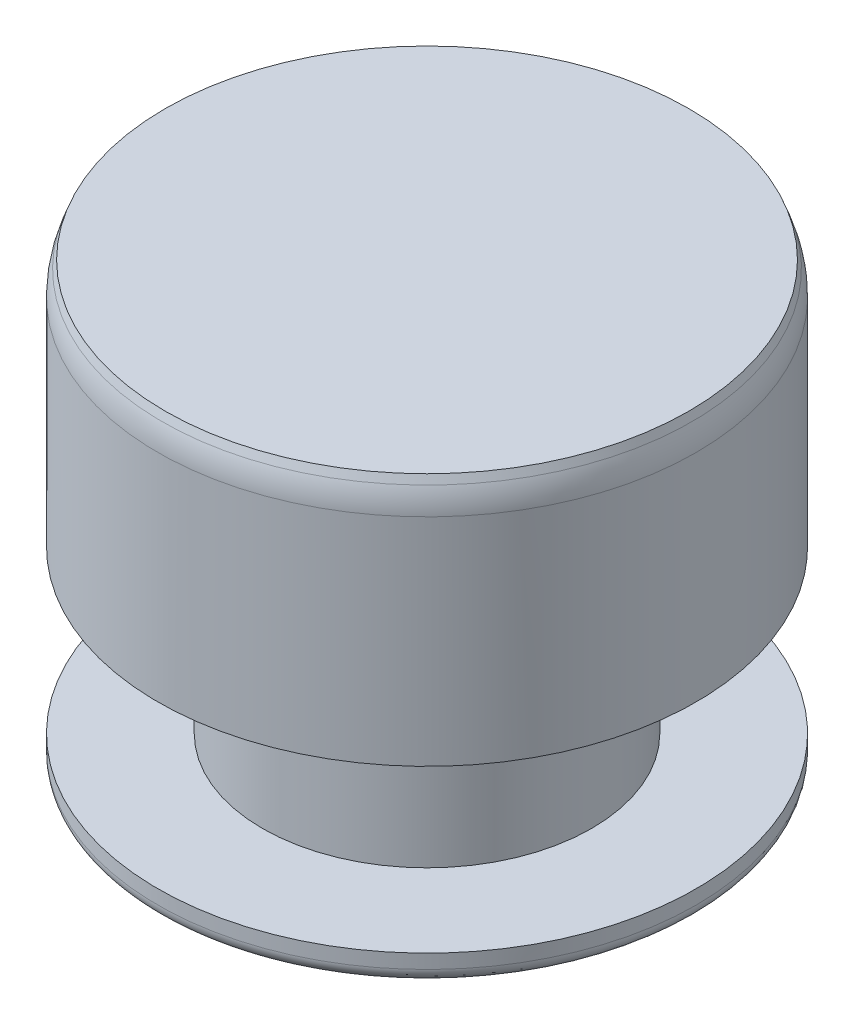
ISO-10303-21;
HEADER;
FILE_DESCRIPTION(('STEP AP214'),'2;1');
FILE_NAME('part.step','',(''),(''),'','','');
FILE_SCHEMA(('AUTOMOTIVE_DESIGN { 1 0 10303 214 1 1 1 1 }'));
ENDSEC;
DATA;
#1=APPLICATION_CONTEXT('core data for automotive mechanical design processes');
#2=APPLICATION_PROTOCOL_DEFINITION('international standard','automotive_design',2000,#1);
#3=PRODUCT_CONTEXT('',#1,'mechanical');
#4=PRODUCT('Part','Part','',(#3));
#5=PRODUCT_RELATED_PRODUCT_CATEGORY('part','',(#4));
#6=PRODUCT_DEFINITION_FORMATION('','',#4);
#7=PRODUCT_DEFINITION_CONTEXT('part definition',#1,'design');
#8=PRODUCT_DEFINITION('design','',#6,#7);
#9=PRODUCT_DEFINITION_SHAPE('','',#8);
#10=(LENGTH_UNIT() NAMED_UNIT(*) SI_UNIT(.MILLI.,.METRE.));
#11=(NAMED_UNIT(*) PLANE_ANGLE_UNIT() SI_UNIT($,.RADIAN.));
#12=(NAMED_UNIT(*) SI_UNIT($,.STERADIAN.) SOLID_ANGLE_UNIT());
#13=UNCERTAINTY_MEASURE_WITH_UNIT(LENGTH_MEASURE(1.E-05),#10,'distance_accuracy_value','');
#14=(GEOMETRIC_REPRESENTATION_CONTEXT(3) GLOBAL_UNCERTAINTY_ASSIGNED_CONTEXT((#13)) GLOBAL_UNIT_ASSIGNED_CONTEXT((#10,
#11,#12)) REPRESENTATION_CONTEXT('',''));
#15=CARTESIAN_POINT('',(0.,0.,0.));
#16=DIRECTION('',(0.,0.,1.));
#17=DIRECTION('',(1.,0.,0.));
#18=AXIS2_PLACEMENT_3D('',#15,#16,#17);
#19=CARTESIAN_POINT('',(3.66,0.,0.));
#20=DIRECTION('',(0.,-1.,0.));
#21=DIRECTION('',(1.,0.,0.));
#22=AXIS2_PLACEMENT_3D('',#19,#20,#21);
#23=PLANE('',#22);
#24=CARTESIAN_POINT('',(0.,0.,0.));
#25=DIRECTION('',(0.,1.,0.));
#26=DIRECTION('',(-1.,0.,0.));
#27=AXIS2_PLACEMENT_3D('',#24,#25,#26);
#28=CIRCLE('',#27,3.66);
#29=CARTESIAN_POINT('',(-3.66,0.,0.));
#30=VERTEX_POINT('',#29);
#31=EDGE_CURVE('E81',#30,#30,#28,.T.);
#32=ORIENTED_EDGE('',*,*,#31,.T.);
#33=EDGE_LOOP('',(#32));
#34=FACE_BOUND('',#33,.T.);
#35=ADVANCED_FACE('F46',(#34),#23,.F.);
#36=CARTESIAN_POINT('',(0.500000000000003,-7.99956969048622,0.));
#37=DIRECTION('',(0.,1.,0.));
#38=DIRECTION('',(-1.,0.,0.));
#39=AXIS2_PLACEMENT_3D('',#36,#37,#38);
#40=PLANE('',#39);
#41=CARTESIAN_POINT('',(0.,-7.99956969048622,0.));
#42=DIRECTION('',(0.,1.,0.));
#43=DIRECTION('',(-1.,0.,0.));
#44=AXIS2_PLACEMENT_3D('',#41,#42,#43);
#45=CIRCLE('',#44,0.5);
#46=CARTESIAN_POINT('',(-0.499999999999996,-7.99956969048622,0.));
#47=VERTEX_POINT('',#46);
#48=EDGE_CURVE('E66',#47,#47,#45,.T.);
#49=ORIENTED_EDGE('',*,*,#48,.F.);
#50=EDGE_LOOP('',(#49));
#51=FACE_BOUND('',#50,.T.);
#52=ADVANCED_FACE('F99',(#51),#40,.F.);
#53=CARTESIAN_POINT('',(0.,-7.99956969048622,0.));
#54=DIRECTION('',(0.,1.,0.));
#55=DIRECTION('',(-1.,0.,0.));
#56=AXIS2_PLACEMENT_3D('',#53,#54,#55);
#57=CONICAL_SURFACE('',#56,0.5,1.02974425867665);
#58=CARTESIAN_POINT('',(0.,-6.09904297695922,0.));
#59=DIRECTION('',(0.,-1.,0.));
#60=DIRECTION('',(1.,0.,0.));
#61=AXIS2_PLACEMENT_3D('',#58,#59,#60);
#62=CIRCLE('',#61,3.66300761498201);
#63=CARTESIAN_POINT('',(-3.66300761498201,-6.09904297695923,0.));
#64=VERTEX_POINT('',#63);
#65=EDGE_CURVE('E57',#64,#64,#62,.T.);
#66=CARTESIAN_POINT('',(-3.66300761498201,-6.09904297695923,0.));
#67=CARTESIAN_POINT('',(-3.63005961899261,-6.11884013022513,0.));
#68=CARTESIAN_POINT('',(-3.59711162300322,-6.13863728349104,0.));
#69=CARTESIAN_POINT('',(-3.53121563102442,-6.17823159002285,0.));
#70=CARTESIAN_POINT('',(-3.49826763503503,-6.19802874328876,0.));
#71=CARTESIAN_POINT('',(-3.43237164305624,-6.23762304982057,0.));
#72=CARTESIAN_POINT('',(-3.39942364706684,-6.25742020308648,0.));
#73=CARTESIAN_POINT('',(-3.33352765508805,-6.29701450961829,0.));
#74=CARTESIAN_POINT('',(-3.30057965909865,-6.31681166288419,0.));
#75=CARTESIAN_POINT('',(-3.23468366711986,-6.35640596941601,0.));
#76=CARTESIAN_POINT('',(-3.20173567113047,-6.37620312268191,0.));
#77=CARTESIAN_POINT('',(-3.13583967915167,-6.41579742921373,0.));
#78=CARTESIAN_POINT('',(-3.10289168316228,-6.43559458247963,0.));
#79=CARTESIAN_POINT('',(-3.03699569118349,-6.47518888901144,0.));
#80=CARTESIAN_POINT('',(-3.00404769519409,-6.49498604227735,0.));
#81=CARTESIAN_POINT('',(-2.9381517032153,-6.53458034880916,0.));
#82=CARTESIAN_POINT('',(-2.9052037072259,-6.55437750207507,0.));
#83=CARTESIAN_POINT('',(-2.83930771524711,-6.59397180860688,0.));
#84=CARTESIAN_POINT('',(-2.80635971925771,-6.61376896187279,0.));
#85=CARTESIAN_POINT('',(-2.74046372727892,-6.6533632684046,0.));
#86=CARTESIAN_POINT('',(-2.70751573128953,-6.67316042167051,0.));
#87=CARTESIAN_POINT('',(-2.64161973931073,-6.71275472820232,0.));
#88=CARTESIAN_POINT('',(-2.60867174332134,-6.73255188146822,0.));
#89=CARTESIAN_POINT('',(-2.54277575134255,-6.77214618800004,0.));
#90=CARTESIAN_POINT('',(-2.50982775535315,-6.79194334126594,0.));
#91=CARTESIAN_POINT('',(-2.44393176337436,-6.83153764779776,0.));
#92=CARTESIAN_POINT('',(-2.41098376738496,-6.85133480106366,0.));
#93=CARTESIAN_POINT('',(-2.34508777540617,-6.89092910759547,0.));
#94=CARTESIAN_POINT('',(-2.31213977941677,-6.91072626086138,0.));
#95=CARTESIAN_POINT('',(-2.24624378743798,-6.95032056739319,0.));
#96=CARTESIAN_POINT('',(-2.21329579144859,-6.9701177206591,0.));
#97=CARTESIAN_POINT('',(-2.14739979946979,-7.00971202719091,0.));
#98=CARTESIAN_POINT('',(-2.1144518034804,-7.02950918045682,0.));
#99=CARTESIAN_POINT('',(-2.04855581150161,-7.06910348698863,0.));
#100=CARTESIAN_POINT('',(-2.01560781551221,-7.08890064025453,0.));
#101=CARTESIAN_POINT('',(-1.94971182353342,-7.12849494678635,0.));
#102=CARTESIAN_POINT('',(-1.91676382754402,-7.14829210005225,0.));
#103=CARTESIAN_POINT('',(-1.85086783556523,-7.18788640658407,0.));
#104=CARTESIAN_POINT('',(-1.81791983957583,-7.20768355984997,0.));
#105=CARTESIAN_POINT('',(-1.75202384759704,-7.24727786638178,0.));
#106=CARTESIAN_POINT('',(-1.71907585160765,-7.26707501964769,0.));
#107=CARTESIAN_POINT('',(-1.65317985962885,-7.3066693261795,0.));
#108=CARTESIAN_POINT('',(-1.62023186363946,-7.32646647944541,0.));
#109=CARTESIAN_POINT('',(-1.55433587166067,-7.36606078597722,0.));
#110=CARTESIAN_POINT('',(-1.52138787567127,-7.38585793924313,0.));
#111=CARTESIAN_POINT('',(-1.45549188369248,-7.42545224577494,0.));
#112=CARTESIAN_POINT('',(-1.42254388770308,-7.44524939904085,0.));
#113=CARTESIAN_POINT('',(-1.35664789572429,-7.48484370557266,0.));
#114=CARTESIAN_POINT('',(-1.32369989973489,-7.50464085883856,0.));
#115=CARTESIAN_POINT('',(-1.2578039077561,-7.54423516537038,0.));
#116=CARTESIAN_POINT('',(-1.22485591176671,-7.56403231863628,0.));
#117=CARTESIAN_POINT('',(-1.15895991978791,-7.6036266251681,0.));
#118=CARTESIAN_POINT('',(-1.12601192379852,-7.623423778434,0.));
#119=CARTESIAN_POINT('',(-1.06011593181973,-7.66301808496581,0.));
#120=CARTESIAN_POINT('',(-1.02716793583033,-7.68281523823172,0.));
#121=CARTESIAN_POINT('',(-0.961271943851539,-7.72240954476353,0.));
#122=CARTESIAN_POINT('',(-0.928323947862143,-7.74220669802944,0.));
#123=CARTESIAN_POINT('',(-0.862427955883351,-7.78180100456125,0.));
#124=CARTESIAN_POINT('',(-0.829479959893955,-7.80159815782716,0.));
#125=CARTESIAN_POINT('',(-0.763583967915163,-7.84119246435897,0.));
#126=CARTESIAN_POINT('',(-0.730635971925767,-7.86098961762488,0.));
#127=CARTESIAN_POINT('',(-0.664739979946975,-7.90058392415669,0.));
#128=CARTESIAN_POINT('',(-0.631791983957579,-7.9203810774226,0.));
#129=CARTESIAN_POINT('',(-0.565895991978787,-7.95997538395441,0.));
#130=CARTESIAN_POINT('',(-0.532947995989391,-7.97977253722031,0.));
#131=CARTESIAN_POINT('',(-0.499999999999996,-7.99956969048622,0.));
#132=B_SPLINE_CURVE_WITH_KNOTS('',3,(#66,#67,#68,#69,#70,#71,#72,#73,#74,#75,#76,#77,#78,#79,
#80,#81,#82,#83,#84,#85,#86,#87,#88,#89,#90,#91,#92,#93,#94,#95,#96,#97,#98,#99,#100,#101,#102,
#103,#104,#105,#106,#107,#108,#109,#110,#111,#112,#113,#114,#115,#116,#117,#118,#119,#120,#121,
#122,#123,#124,#125,#126,#127,#128,#129,#130,#131),.UNSPECIFIED.,.F.,.F.,(4,2,2,2,2,2,2,2,2,2,2,
2,2,2,2,2,2,2,2,2,2,2,2,2,2,2,2,2,2,2,2,2,4),(0.,0.115314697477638,0.230629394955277,
0.345944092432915,0.461258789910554,0.576573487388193,0.691888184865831,0.80720288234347,
0.922517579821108,1.03783227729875,1.15314697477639,1.26846167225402,1.38377636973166,
1.4990910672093,1.61440576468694,1.72972046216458,1.84503515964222,1.96034985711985,
2.07566455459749,2.19097925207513,2.30629394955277,2.42160864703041,2.53692334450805,
2.65223804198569,2.76755273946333,2.88286743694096,2.9981821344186,3.11349683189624,
3.22881152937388,3.34412622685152,3.45944092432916,3.5747556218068,3.69007031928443),.UNSPECIFIED.);
#133=EDGE_CURVE('BSEAM104',#64,#47,#132,.T.);
#134=ORIENTED_EDGE('',*,*,#65,.T.);
#135=ORIENTED_EDGE('',*,*,#48,.T.);
#136=ORIENTED_EDGE('',*,*,#133,.T.);
#137=ORIENTED_EDGE('',*,*,#133,.F.);
#138=EDGE_LOOP('',(#134,#136,#135,#137));
#139=FACE_BOUND('',#138,.T.);
#140=ADVANCED_FACE('F104',(#139),#57,.T.);
#141=CARTESIAN_POINT('',(0.,0.,0.));
#142=DIRECTION('',(0.,1.,0.));
#143=DIRECTION('',(-1.,0.,0.));
#144=AXIS2_PLACEMENT_3D('',#141,#142,#143);
#145=CYLINDRICAL_SURFACE('',#144,3.76);
#146=CARTESIAN_POINT('',(0.,-5.9276095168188,0.));
#147=DIRECTION('',(0.,-1.,0.));
#148=DIRECTION('',(1.,0.,0.));
#149=AXIS2_PLACEMENT_3D('',#146,#147,#148);
#150=CIRCLE('',#149,3.76);
#151=CARTESIAN_POINT('',(3.76,-5.9276095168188,0.));
#152=VERTEX_POINT('',#151);
#153=EDGE_CURVE('E61',#152,#152,#150,.F.);
#154=ORIENTED_EDGE('',*,*,#153,.T.);
#155=EDGE_LOOP('',(#154));
#156=FACE_BOUND('',#155,.T.);
#157=CARTESIAN_POINT('',(0.,-5.73,0.));
#158=DIRECTION('',(0.,1.,0.));
#159=DIRECTION('',(-1.,0.,0.));
#160=AXIS2_PLACEMENT_3D('',#157,#158,#159);
#161=CIRCLE('',#160,3.76);
#162=CARTESIAN_POINT('',(-3.76,-5.73,0.));
#163=VERTEX_POINT('',#162);
#164=EDGE_CURVE('E69',#163,#163,#161,.T.);
#165=ORIENTED_EDGE('',*,*,#164,.F.);
#166=EDGE_LOOP('',(#165));
#167=FACE_BOUND('',#166,.T.);
#168=ADVANCED_FACE('F110',(#156,#167),#145,.T.);
#169=CARTESIAN_POINT('',(3.76,-5.73,0.));
#170=DIRECTION('',(0.,-1.,0.));
#171=DIRECTION('',(1.,0.,0.));
#172=AXIS2_PLACEMENT_3D('',#169,#170,#171);
#173=PLANE('',#172);
#174=CARTESIAN_POINT('',(0.,-5.73,0.));
#175=DIRECTION('',(0.,1.,0.));
#176=DIRECTION('',(-1.,0.,0.));
#177=AXIS2_PLACEMENT_3D('',#174,#175,#176);
#178=CIRCLE('',#177,2.3);
#179=CARTESIAN_POINT('',(-2.3,-5.73,0.));
#180=VERTEX_POINT('',#179);
#181=EDGE_CURVE('E72',#180,#180,#178,.T.);
#182=ORIENTED_EDGE('',*,*,#181,.F.);
#183=EDGE_LOOP('',(#182));
#184=FACE_BOUND('',#183,.T.);
#185=ORIENTED_EDGE('',*,*,#164,.T.);
#186=EDGE_LOOP('',(#185));
#187=FACE_BOUND('',#186,.T.);
#188=ADVANCED_FACE('F114',(#184,#187),#173,.F.);
#189=CARTESIAN_POINT('',(0.,0.,0.));
#190=DIRECTION('',(0.,1.,0.));
#191=DIRECTION('',(-1.,0.,0.));
#192=AXIS2_PLACEMENT_3D('',#189,#190,#191);
#193=CYLINDRICAL_SURFACE('',#192,2.3);
#194=CARTESIAN_POINT('',(0.,-3.47,0.));
#195=DIRECTION('',(0.,1.,0.));
#196=DIRECTION('',(-1.,0.,0.));
#197=AXIS2_PLACEMENT_3D('',#194,#195,#196);
#198=CIRCLE('',#197,2.3);
#199=CARTESIAN_POINT('',(-2.3,-3.47,0.));
#200=VERTEX_POINT('',#199);
#201=EDGE_CURVE('E75',#200,#200,#198,.T.);
#202=ORIENTED_EDGE('',*,*,#201,.F.);
#203=EDGE_LOOP('',(#202));
#204=FACE_BOUND('',#203,.T.);
#205=ORIENTED_EDGE('',*,*,#181,.T.);
#206=EDGE_LOOP('',(#205));
#207=FACE_BOUND('',#206,.T.);
#208=ADVANCED_FACE('F118',(#204,#207),#193,.T.);
#209=CARTESIAN_POINT('',(2.3,-3.47,0.));
#210=DIRECTION('',(0.,1.,0.));
#211=DIRECTION('',(-1.,0.,0.));
#212=AXIS2_PLACEMENT_3D('',#209,#210,#211);
#213=PLANE('',#212);
#214=CARTESIAN_POINT('',(0.,-3.47,0.));
#215=DIRECTION('',(0.,1.,0.));
#216=DIRECTION('',(-1.,0.,0.));
#217=AXIS2_PLACEMENT_3D('',#214,#215,#216);
#218=CIRCLE('',#217,3.76);
#219=CARTESIAN_POINT('',(-3.76,-3.47,0.));
#220=VERTEX_POINT('',#219);
#221=EDGE_CURVE('E78',#220,#220,#218,.T.);
#222=ORIENTED_EDGE('',*,*,#221,.F.);
#223=EDGE_LOOP('',(#222));
#224=FACE_BOUND('',#223,.T.);
#225=ORIENTED_EDGE('',*,*,#201,.T.);
#226=EDGE_LOOP('',(#225));
#227=FACE_BOUND('',#226,.T.);
#228=ADVANCED_FACE('F96',(#224,#227),#213,.F.);
#229=CARTESIAN_POINT('',(0.,0.,0.));
#230=DIRECTION('',(0.,1.,0.));
#231=DIRECTION('',(-1.,0.,0.));
#232=AXIS2_PLACEMENT_3D('',#229,#230,#231);
#233=CYLINDRICAL_SURFACE('',#232,3.76);
#234=CARTESIAN_POINT('',(0.,-0.451074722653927,0.));
#235=DIRECTION('',(0.,-1.,0.));
#236=DIRECTION('',(1.,0.,0.));
#237=AXIS2_PLACEMENT_3D('',#234,#235,#236);
#238=CIRCLE('',#237,3.76);
#239=CARTESIAN_POINT('',(3.76,-0.451074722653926,0.));
#240=VERTEX_POINT('',#239);
#241=EDGE_CURVE('E12',#240,#240,#238,.T.);
#242=ORIENTED_EDGE('',*,*,#241,.T.);
#243=EDGE_LOOP('',(#242));
#244=FACE_BOUND('',#243,.T.);
#245=ORIENTED_EDGE('',*,*,#221,.T.);
#246=EDGE_LOOP('',(#245));
#247=FACE_BOUND('',#246,.T.);
#248=ADVANCED_FACE('F89',(#244,#247),#233,.T.);
#249=CARTESIAN_POINT('',(0.,-0.274747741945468,0.));
#250=DIRECTION('',(0.,-1.,0.));
#251=DIRECTION('',(1.,0.,0.));
#252=AXIS2_PLACEMENT_3D('',#249,#250,#251);
#253=CONICAL_SURFACE('',#252,3.76,0.34906585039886);
#254=CARTESIAN_POINT('',(0.,-0.109054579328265,0.));
#255=DIRECTION('',(0.,1.,0.));
#256=DIRECTION('',(-1.,0.,0.));
#257=AXIS2_PLACEMENT_3D('',#254,#255,#256);
#258=CIRCLE('',#257,3.69969262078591);
#259=CARTESIAN_POINT('',(-3.69969262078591,-0.109054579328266,0.));
#260=VERTEX_POINT('',#259);
#261=EDGE_CURVE('E53',#260,#260,#258,.T.);
#262=ORIENTED_EDGE('',*,*,#261,.T.);
#263=EDGE_LOOP('',(#262));
#264=FACE_BOUND('',#263,.T.);
#265=ORIENTED_EDGE('',*,*,#31,.F.);
#266=EDGE_LOOP('',(#265));
#267=FACE_BOUND('',#266,.T.);
#268=ADVANCED_FACE('F86',(#264,#267),#253,.T.);
#269=CARTESIAN_POINT('',(0.,-5.9276095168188,0.));
#270=DIRECTION('',(0.,-1.,0.));
#271=DIRECTION('',(1.,0.,0.));
#272=AXIS2_PLACEMENT_3D('',#269,#270,#271);
#273=TOROIDAL_SURFACE('',#272,3.56,0.2);
#274=ORIENTED_EDGE('',*,*,#65,.F.);
#275=EDGE_LOOP('',(#274));
#276=FACE_BOUND('',#275,.T.);
#277=ORIENTED_EDGE('',*,*,#153,.F.);
#278=EDGE_LOOP('',(#277));
#279=FACE_BOUND('',#278,.T.);
#280=ADVANCED_FACE('F88',(#276,#279),#273,.T.);
#281=CARTESIAN_POINT('',(0.,-0.451074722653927,0.));
#282=DIRECTION('',(0.,-1.,0.));
#283=DIRECTION('',(1.,0.,0.));
#284=AXIS2_PLACEMENT_3D('',#281,#282,#283);
#285=TOROIDAL_SURFACE('',#284,2.76,1.);
#286=ORIENTED_EDGE('',*,*,#241,.F.);
#287=EDGE_LOOP('',(#286));
#288=FACE_BOUND('',#287,.T.);
#289=ORIENTED_EDGE('',*,*,#261,.F.);
#290=EDGE_LOOP('',(#289));
#291=FACE_BOUND('',#290,.T.);
#292=ADVANCED_FACE('F48',(#288,#291),#285,.T.);
#293=CLOSED_SHELL('',(#35,#52,#140,#168,#188,#208,#228,#248,#268,#280,#292));
#294=MANIFOLD_SOLID_BREP('B2',#293);
#295=ADVANCED_BREP_SHAPE_REPRESENTATION('',(#18,#294),#14);
#296=SHAPE_DEFINITION_REPRESENTATION(#9,#295);
ENDSEC;
END-ISO-10303-21;
